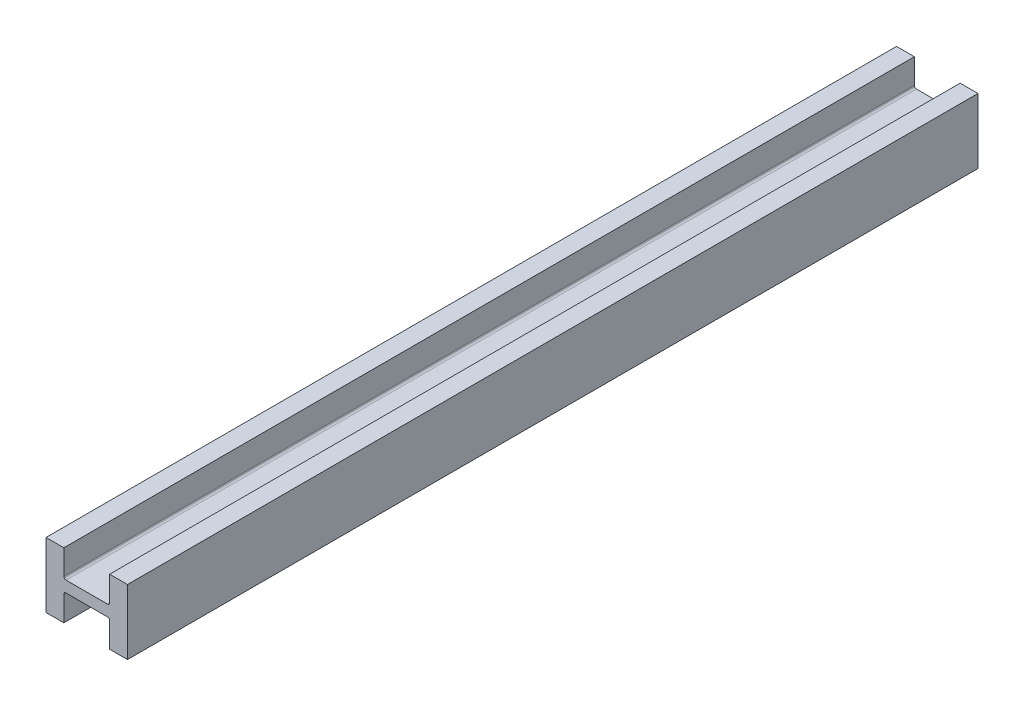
ISO-10303-21;
HEADER;
FILE_DESCRIPTION(('STEP AP214'),'2;1');
FILE_NAME('part.step','',(''),(''),'','','');
FILE_SCHEMA(('AUTOMOTIVE_DESIGN { 1 0 10303 214 1 1 1 1 }'));
ENDSEC;
DATA;
#1=APPLICATION_CONTEXT('core data for automotive mechanical design processes');
#2=APPLICATION_PROTOCOL_DEFINITION('international standard','automotive_design',2000,#1);
#3=PRODUCT_CONTEXT('',#1,'mechanical');
#4=PRODUCT('Part','Part','',(#3));
#5=PRODUCT_RELATED_PRODUCT_CATEGORY('part','',(#4));
#6=PRODUCT_DEFINITION_FORMATION('','',#4);
#7=PRODUCT_DEFINITION_CONTEXT('part definition',#1,'design');
#8=PRODUCT_DEFINITION('design','',#6,#7);
#9=PRODUCT_DEFINITION_SHAPE('','',#8);
#10=(LENGTH_UNIT() NAMED_UNIT(*) SI_UNIT(.MILLI.,.METRE.));
#11=(NAMED_UNIT(*) PLANE_ANGLE_UNIT() SI_UNIT($,.RADIAN.));
#12=(NAMED_UNIT(*) SI_UNIT($,.STERADIAN.) SOLID_ANGLE_UNIT());
#13=UNCERTAINTY_MEASURE_WITH_UNIT(LENGTH_MEASURE(1.E-05),#10,'distance_accuracy_value','');
#14=(GEOMETRIC_REPRESENTATION_CONTEXT(3) GLOBAL_UNCERTAINTY_ASSIGNED_CONTEXT((#13)) GLOBAL_UNIT_ASSIGNED_CONTEXT((#10,
#11,#12)) REPRESENTATION_CONTEXT('',''));
#15=CARTESIAN_POINT('',(0.,0.,0.));
#16=DIRECTION('',(0.,0.,1.));
#17=DIRECTION('',(1.,0.,0.));
#18=AXIS2_PLACEMENT_3D('',#15,#16,#17);
#19=CARTESIAN_POINT('',(284.734,227.203,2971.8));
#20=DIRECTION('',(-1.,0.,0.));
#21=DIRECTION('',(0.,0.,1.));
#22=AXIS2_PLACEMENT_3D('',#19,#20,#21);
#23=PLANE('',#22);
#24=DIRECTION('',(0.,1.,0.));
#25=VECTOR('',#24,1.);
#26=CARTESIAN_POINT('',(284.734,227.203,-2971.8));
#27=LINE('',#26,#25);
#28=CARTESIAN_POINT('',(284.734,-227.203,-2971.8));
#29=VERTEX_POINT('',#28);
#30=CARTESIAN_POINT('',(284.734,227.203,-2971.8));
#31=VERTEX_POINT('',#30);
#32=EDGE_CURVE('E194',#29,#31,#27,.T.);
#33=ORIENTED_EDGE('',*,*,#32,.T.);
#34=DIRECTION('',(0.,0.,-1.));
#35=VECTOR('',#34,1.);
#36=CARTESIAN_POINT('',(284.734,227.203,2971.8));
#37=LINE('',#36,#35);
#38=CARTESIAN_POINT('',(284.734,227.203,2971.8));
#39=VERTEX_POINT('',#38);
#40=EDGE_CURVE('E11',#39,#31,#37,.T.);
#41=ORIENTED_EDGE('',*,*,#40,.F.);
#42=DIRECTION('',(0.,1.,0.));
#43=VECTOR('',#42,1.);
#44=CARTESIAN_POINT('',(284.734,227.203,2971.8));
#45=LINE('',#44,#43);
#46=CARTESIAN_POINT('',(284.734,-227.203,2971.8));
#47=VERTEX_POINT('',#46);
#48=EDGE_CURVE('E238',#47,#39,#45,.T.);
#49=ORIENTED_EDGE('',*,*,#48,.F.);
#50=DIRECTION('',(0.,0.,-1.));
#51=VECTOR('',#50,1.);
#52=CARTESIAN_POINT('',(284.734,-227.203,2971.8));
#53=LINE('',#52,#51);
#54=EDGE_CURVE('E188',#47,#29,#53,.T.);
#55=ORIENTED_EDGE('',*,*,#54,.T.);
#56=EDGE_LOOP('',(#33,#41,#49,#55));
#57=FACE_BOUND('',#56,.T.);
#58=ADVANCED_FACE('F44',(#57),#23,.F.);
#59=CARTESIAN_POINT('',(160.02,227.203,2971.8));
#60=DIRECTION('',(0.,-1.,0.));
#61=DIRECTION('',(0.,0.,-1.));
#62=AXIS2_PLACEMENT_3D('',#59,#60,#61);
#63=PLANE('',#62);
#64=DIRECTION('',(-1.,0.,0.));
#65=VECTOR('',#64,1.);
#66=CARTESIAN_POINT('',(160.02,227.203,-2971.8));
#67=LINE('',#66,#65);
#68=CARTESIAN_POINT('',(160.02,227.203,-2971.8));
#69=VERTEX_POINT('',#68);
#70=EDGE_CURVE('E196',#31,#69,#67,.T.);
#71=ORIENTED_EDGE('',*,*,#70,.T.);
#72=DIRECTION('',(0.,0.,-1.));
#73=VECTOR('',#72,1.);
#74=CARTESIAN_POINT('',(160.02,227.203,2971.8));
#75=LINE('',#74,#73);
#76=CARTESIAN_POINT('',(160.02,227.203,2971.8));
#77=VERTEX_POINT('',#76);
#78=EDGE_CURVE('E53',#77,#69,#75,.T.);
#79=ORIENTED_EDGE('',*,*,#78,.F.);
#80=DIRECTION('',(-1.,0.,0.));
#81=VECTOR('',#80,1.);
#82=CARTESIAN_POINT('',(160.02,227.203,2971.8));
#83=LINE('',#82,#81);
#84=EDGE_CURVE('E129',#39,#77,#83,.T.);
#85=ORIENTED_EDGE('',*,*,#84,.F.);
#86=ORIENTED_EDGE('',*,*,#40,.T.);
#87=EDGE_LOOP('',(#71,#79,#85,#86));
#88=FACE_BOUND('',#87,.T.);
#89=ADVANCED_FACE('F362',(#88),#63,.F.);
#90=CARTESIAN_POINT('',(160.02,54.229,2971.8));
#91=DIRECTION('',(1.,0.,0.));
#92=DIRECTION('',(0.,0.,-1.));
#93=AXIS2_PLACEMENT_3D('',#90,#91,#92);
#94=PLANE('',#93);
#95=DIRECTION('',(0.,-1.,0.));
#96=VECTOR('',#95,1.);
#97=CARTESIAN_POINT('',(160.02,54.229,-2971.8));
#98=LINE('',#97,#96);
#99=CARTESIAN_POINT('',(160.02,54.229,-2971.8));
#100=VERTEX_POINT('',#99);
#101=EDGE_CURVE('E203',#69,#100,#98,.T.);
#102=ORIENTED_EDGE('',*,*,#101,.T.);
#103=DIRECTION('',(0.,0.,-1.));
#104=VECTOR('',#103,1.);
#105=CARTESIAN_POINT('',(160.02,54.229,2971.8));
#106=LINE('',#105,#104);
#107=CARTESIAN_POINT('',(160.02,54.229,2971.8));
#108=VERTEX_POINT('',#107);
#109=EDGE_CURVE('E284',#108,#100,#106,.T.);
#110=ORIENTED_EDGE('',*,*,#109,.F.);
#111=DIRECTION('',(0.,-1.,0.));
#112=VECTOR('',#111,1.);
#113=CARTESIAN_POINT('',(160.02,54.229,2971.8));
#114=LINE('',#113,#112);
#115=EDGE_CURVE('E291',#77,#108,#114,.T.);
#116=ORIENTED_EDGE('',*,*,#115,.F.);
#117=ORIENTED_EDGE('',*,*,#78,.T.);
#118=EDGE_LOOP('',(#102,#110,#116,#117));
#119=FACE_BOUND('',#118,.T.);
#120=ADVANCED_FACE('F292',(#119),#94,.F.);
#121=CARTESIAN_POINT('',(144.78,54.229,2971.8));
#122=DIRECTION('',(0.,0.,-1.));
#123=DIRECTION('',(-1.,0.,0.));
#124=AXIS2_PLACEMENT_3D('',#121,#122,#123);
#125=CYLINDRICAL_SURFACE('',#124,15.24);
#126=CARTESIAN_POINT('',(144.78,54.229,-2971.8));
#127=DIRECTION('',(0.,0.,-1.));
#128=DIRECTION('',(1.,0.,0.));
#129=AXIS2_PLACEMENT_3D('',#126,#127,#128);
#130=CIRCLE('',#129,15.24);
#131=CARTESIAN_POINT('',(144.78,38.989,-2971.8));
#132=VERTEX_POINT('',#131);
#133=EDGE_CURVE('E204',#100,#132,#130,.T.);
#134=ORIENTED_EDGE('',*,*,#133,.T.);
#135=DIRECTION('',(0.,0.,-1.));
#136=VECTOR('',#135,1.);
#137=CARTESIAN_POINT('',(144.78,38.989,2971.8));
#138=LINE('',#137,#136);
#139=CARTESIAN_POINT('',(144.78,38.989,2971.8));
#140=VERTEX_POINT('',#139);
#141=EDGE_CURVE('E276',#140,#132,#138,.T.);
#142=ORIENTED_EDGE('',*,*,#141,.F.);
#143=CARTESIAN_POINT('',(144.78,54.229,2971.8));
#144=DIRECTION('',(0.,0.,-1.));
#145=DIRECTION('',(1.,0.,0.));
#146=AXIS2_PLACEMENT_3D('',#143,#144,#145);
#147=CIRCLE('',#146,15.24);
#148=EDGE_CURVE('E315',#108,#140,#147,.T.);
#149=ORIENTED_EDGE('',*,*,#148,.F.);
#150=ORIENTED_EDGE('',*,*,#109,.T.);
#151=EDGE_LOOP('',(#134,#142,#149,#150));
#152=FACE_BOUND('',#151,.T.);
#153=ADVANCED_FACE('F305',(#152),#125,.F.);
#154=CARTESIAN_POINT('',(-144.78,38.989,2971.8));
#155=DIRECTION('',(0.,-1.,0.));
#156=DIRECTION('',(0.,0.,-1.));
#157=AXIS2_PLACEMENT_3D('',#154,#155,#156);
#158=PLANE('',#157);
#159=DIRECTION('',(-1.,0.,0.));
#160=VECTOR('',#159,1.);
#161=CARTESIAN_POINT('',(-144.78,38.989,-2971.8));
#162=LINE('',#161,#160);
#163=CARTESIAN_POINT('',(-144.78,38.989,-2971.8));
#164=VERTEX_POINT('',#163);
#165=EDGE_CURVE('E210',#132,#164,#162,.T.);
#166=ORIENTED_EDGE('',*,*,#165,.T.);
#167=DIRECTION('',(0.,0.,-1.));
#168=VECTOR('',#167,1.);
#169=CARTESIAN_POINT('',(-144.78,38.989,2971.8));
#170=LINE('',#169,#168);
#171=CARTESIAN_POINT('',(-144.78,38.989,2971.8));
#172=VERTEX_POINT('',#171);
#173=EDGE_CURVE('E274',#172,#164,#170,.T.);
#174=ORIENTED_EDGE('',*,*,#173,.F.);
#175=DIRECTION('',(-1.,0.,0.));
#176=VECTOR('',#175,1.);
#177=CARTESIAN_POINT('',(-144.78,38.989,2971.8));
#178=LINE('',#177,#176);
#179=EDGE_CURVE('E306',#140,#172,#178,.T.);
#180=ORIENTED_EDGE('',*,*,#179,.F.);
#181=ORIENTED_EDGE('',*,*,#141,.T.);
#182=EDGE_LOOP('',(#166,#174,#180,#181));
#183=FACE_BOUND('',#182,.T.);
#184=ADVANCED_FACE('F308',(#183),#158,.F.);
#185=CARTESIAN_POINT('',(-144.78,54.229,2971.8));
#186=DIRECTION('',(0.,0.,-1.));
#187=DIRECTION('',(-1.,0.,0.));
#188=AXIS2_PLACEMENT_3D('',#185,#186,#187);
#189=CYLINDRICAL_SURFACE('',#188,15.24);
#190=CARTESIAN_POINT('',(-144.78,54.229,-2971.8));
#191=DIRECTION('',(0.,0.,-1.));
#192=DIRECTION('',(1.,0.,0.));
#193=AXIS2_PLACEMENT_3D('',#190,#191,#192);
#194=CIRCLE('',#193,15.24);
#195=CARTESIAN_POINT('',(-160.02,54.229,-2971.8));
#196=VERTEX_POINT('',#195);
#197=EDGE_CURVE('E209',#164,#196,#194,.T.);
#198=ORIENTED_EDGE('',*,*,#197,.T.);
#199=DIRECTION('',(0.,0.,-1.));
#200=VECTOR('',#199,1.);
#201=CARTESIAN_POINT('',(-160.02,54.229,2971.8));
#202=LINE('',#201,#200);
#203=CARTESIAN_POINT('',(-160.02,54.229,2971.8));
#204=VERTEX_POINT('',#203);
#205=EDGE_CURVE('E271',#204,#196,#202,.T.);
#206=ORIENTED_EDGE('',*,*,#205,.F.);
#207=CARTESIAN_POINT('',(-144.78,54.229,2971.8));
#208=DIRECTION('',(0.,0.,-1.));
#209=DIRECTION('',(1.,0.,0.));
#210=AXIS2_PLACEMENT_3D('',#207,#208,#209);
#211=CIRCLE('',#210,15.24);
#212=EDGE_CURVE('E313',#172,#204,#211,.T.);
#213=ORIENTED_EDGE('',*,*,#212,.F.);
#214=ORIENTED_EDGE('',*,*,#173,.T.);
#215=EDGE_LOOP('',(#198,#206,#213,#214));
#216=FACE_BOUND('',#215,.T.);
#217=ADVANCED_FACE('F374',(#216),#189,.F.);
#218=CARTESIAN_POINT('',(-160.02,227.203,2971.8));
#219=DIRECTION('',(-1.,0.,0.));
#220=DIRECTION('',(0.,0.,1.));
#221=AXIS2_PLACEMENT_3D('',#218,#219,#220);
#222=PLANE('',#221);
#223=DIRECTION('',(0.,1.,0.));
#224=VECTOR('',#223,1.);
#225=CARTESIAN_POINT('',(-160.02,227.203,-2971.8));
#226=LINE('',#225,#224);
#227=CARTESIAN_POINT('',(-160.02,227.203,-2971.8));
#228=VERTEX_POINT('',#227);
#229=EDGE_CURVE('E213',#196,#228,#226,.T.);
#230=ORIENTED_EDGE('',*,*,#229,.T.);
#231=DIRECTION('',(0.,0.,-1.));
#232=VECTOR('',#231,1.);
#233=CARTESIAN_POINT('',(-160.02,227.203,2971.8));
#234=LINE('',#233,#232);
#235=CARTESIAN_POINT('',(-160.02,227.203,2971.8));
#236=VERTEX_POINT('',#235);
#237=EDGE_CURVE('E270',#236,#228,#234,.T.);
#238=ORIENTED_EDGE('',*,*,#237,.F.);
#239=DIRECTION('',(0.,1.,0.));
#240=VECTOR('',#239,1.);
#241=CARTESIAN_POINT('',(-160.02,227.203,2971.8));
#242=LINE('',#241,#240);
#243=EDGE_CURVE('E316',#204,#236,#242,.T.);
#244=ORIENTED_EDGE('',*,*,#243,.F.);
#245=ORIENTED_EDGE('',*,*,#205,.T.);
#246=EDGE_LOOP('',(#230,#238,#244,#245));
#247=FACE_BOUND('',#246,.T.);
#248=ADVANCED_FACE('F378',(#247),#222,.F.);
#249=CARTESIAN_POINT('',(-284.734,227.203,2971.8));
#250=DIRECTION('',(0.,-1.,0.));
#251=DIRECTION('',(0.,0.,-1.));
#252=AXIS2_PLACEMENT_3D('',#249,#250,#251);
#253=PLANE('',#252);
#254=DIRECTION('',(-1.,0.,0.));
#255=VECTOR('',#254,1.);
#256=CARTESIAN_POINT('',(-284.734,227.203,-2971.8));
#257=LINE('',#256,#255);
#258=CARTESIAN_POINT('',(-284.734,227.203,-2971.8));
#259=VERTEX_POINT('',#258);
#260=EDGE_CURVE('E216',#228,#259,#257,.T.);
#261=ORIENTED_EDGE('',*,*,#260,.T.);
#262=DIRECTION('',(0.,0.,-1.));
#263=VECTOR('',#262,1.);
#264=CARTESIAN_POINT('',(-284.734,227.203,2971.8));
#265=LINE('',#264,#263);
#266=CARTESIAN_POINT('',(-284.734,227.203,2971.8));
#267=VERTEX_POINT('',#266);
#268=EDGE_CURVE('E263',#267,#259,#265,.T.);
#269=ORIENTED_EDGE('',*,*,#268,.F.);
#270=DIRECTION('',(-1.,0.,0.));
#271=VECTOR('',#270,1.);
#272=CARTESIAN_POINT('',(-284.734,227.203,2971.8));
#273=LINE('',#272,#271);
#274=EDGE_CURVE('E323',#236,#267,#273,.T.);
#275=ORIENTED_EDGE('',*,*,#274,.F.);
#276=ORIENTED_EDGE('',*,*,#237,.T.);
#277=EDGE_LOOP('',(#261,#269,#275,#276));
#278=FACE_BOUND('',#277,.T.);
#279=ADVANCED_FACE('F385',(#278),#253,.F.);
#280=CARTESIAN_POINT('',(-284.734,-227.203,2971.8));
#281=DIRECTION('',(1.,0.,0.));
#282=DIRECTION('',(0.,0.,-1.));
#283=AXIS2_PLACEMENT_3D('',#280,#281,#282);
#284=PLANE('',#283);
#285=DIRECTION('',(0.,-1.,0.));
#286=VECTOR('',#285,1.);
#287=CARTESIAN_POINT('',(-284.734,-227.203,-2971.8));
#288=LINE('',#287,#286);
#289=CARTESIAN_POINT('',(-284.734,-227.203,-2971.8));
#290=VERTEX_POINT('',#289);
#291=EDGE_CURVE('E218',#259,#290,#288,.T.);
#292=ORIENTED_EDGE('',*,*,#291,.T.);
#293=DIRECTION('',(0.,0.,-1.));
#294=VECTOR('',#293,1.);
#295=CARTESIAN_POINT('',(-284.734,-227.203,2971.8));
#296=LINE('',#295,#294);
#297=CARTESIAN_POINT('',(-284.734,-227.203,2971.8));
#298=VERTEX_POINT('',#297);
#299=EDGE_CURVE('E259',#298,#290,#296,.T.);
#300=ORIENTED_EDGE('',*,*,#299,.F.);
#301=DIRECTION('',(0.,-1.,0.));
#302=VECTOR('',#301,1.);
#303=CARTESIAN_POINT('',(-284.734,-227.203,2971.8));
#304=LINE('',#303,#302);
#305=EDGE_CURVE('E326',#267,#298,#304,.T.);
#306=ORIENTED_EDGE('',*,*,#305,.F.);
#307=ORIENTED_EDGE('',*,*,#268,.T.);
#308=EDGE_LOOP('',(#292,#300,#306,#307));
#309=FACE_BOUND('',#308,.T.);
#310=ADVANCED_FACE('F387',(#309),#284,.F.);
#311=CARTESIAN_POINT('',(-160.02,-227.203,2971.8));
#312=DIRECTION('',(0.,1.,0.));
#313=DIRECTION('',(0.,0.,1.));
#314=AXIS2_PLACEMENT_3D('',#311,#312,#313);
#315=PLANE('',#314);
#316=DIRECTION('',(1.,0.,0.));
#317=VECTOR('',#316,1.);
#318=CARTESIAN_POINT('',(-160.02,-227.203,-2971.8));
#319=LINE('',#318,#317);
#320=CARTESIAN_POINT('',(-160.02,-227.203,-2971.8));
#321=VERTEX_POINT('',#320);
#322=EDGE_CURVE('E225',#290,#321,#319,.T.);
#323=ORIENTED_EDGE('',*,*,#322,.T.);
#324=DIRECTION('',(0.,0.,-1.));
#325=VECTOR('',#324,1.);
#326=CARTESIAN_POINT('',(-160.02,-227.203,2971.8));
#327=LINE('',#326,#325);
#328=CARTESIAN_POINT('',(-160.02,-227.203,2971.8));
#329=VERTEX_POINT('',#328);
#330=EDGE_CURVE('E254',#329,#321,#327,.T.);
#331=ORIENTED_EDGE('',*,*,#330,.F.);
#332=DIRECTION('',(1.,0.,0.));
#333=VECTOR('',#332,1.);
#334=CARTESIAN_POINT('',(-160.02,-227.203,2971.8));
#335=LINE('',#334,#333);
#336=EDGE_CURVE('E328',#298,#329,#335,.T.);
#337=ORIENTED_EDGE('',*,*,#336,.F.);
#338=ORIENTED_EDGE('',*,*,#299,.T.);
#339=EDGE_LOOP('',(#323,#331,#337,#338));
#340=FACE_BOUND('',#339,.T.);
#341=ADVANCED_FACE('F388',(#340),#315,.F.);
#342=CARTESIAN_POINT('',(-160.02,-54.229,2971.8));
#343=DIRECTION('',(-1.,0.,0.));
#344=DIRECTION('',(0.,0.,1.));
#345=AXIS2_PLACEMENT_3D('',#342,#343,#344);
#346=PLANE('',#345);
#347=DIRECTION('',(0.,1.,0.));
#348=VECTOR('',#347,1.);
#349=CARTESIAN_POINT('',(-160.02,-54.229,-2971.8));
#350=LINE('',#349,#348);
#351=CARTESIAN_POINT('',(-160.02,-54.229,-2971.8));
#352=VERTEX_POINT('',#351);
#353=EDGE_CURVE('E223',#321,#352,#350,.T.);
#354=ORIENTED_EDGE('',*,*,#353,.T.);
#355=DIRECTION('',(0.,0.,-1.));
#356=VECTOR('',#355,1.);
#357=CARTESIAN_POINT('',(-160.02,-54.229,2971.8));
#358=LINE('',#357,#356);
#359=CARTESIAN_POINT('',(-160.02,-54.229,2971.8));
#360=VERTEX_POINT('',#359);
#361=EDGE_CURVE('E253',#360,#352,#358,.T.);
#362=ORIENTED_EDGE('',*,*,#361,.F.);
#363=DIRECTION('',(0.,1.,0.));
#364=VECTOR('',#363,1.);
#365=CARTESIAN_POINT('',(-160.02,-54.229,2971.8));
#366=LINE('',#365,#364);
#367=EDGE_CURVE('E335',#329,#360,#366,.T.);
#368=ORIENTED_EDGE('',*,*,#367,.F.);
#369=ORIENTED_EDGE('',*,*,#330,.T.);
#370=EDGE_LOOP('',(#354,#362,#368,#369));
#371=FACE_BOUND('',#370,.T.);
#372=ADVANCED_FACE('F391',(#371),#346,.F.);
#373=CARTESIAN_POINT('',(-144.78,-54.229,2971.8));
#374=DIRECTION('',(0.,0.,-1.));
#375=DIRECTION('',(-1.,0.,0.));
#376=AXIS2_PLACEMENT_3D('',#373,#374,#375);
#377=CYLINDRICAL_SURFACE('',#376,15.24);
#378=CARTESIAN_POINT('',(-144.78,-54.229,-2971.8));
#379=DIRECTION('',(0.,0.,-1.));
#380=DIRECTION('',(1.,0.,0.));
#381=AXIS2_PLACEMENT_3D('',#378,#379,#380);
#382=CIRCLE('',#381,15.24);
#383=CARTESIAN_POINT('',(-144.78,-38.989,-2971.8));
#384=VERTEX_POINT('',#383);
#385=EDGE_CURVE('E229',#352,#384,#382,.T.);
#386=ORIENTED_EDGE('',*,*,#385,.T.);
#387=DIRECTION('',(0.,0.,-1.));
#388=VECTOR('',#387,1.);
#389=CARTESIAN_POINT('',(-144.78,-38.989,2971.8));
#390=LINE('',#389,#388);
#391=CARTESIAN_POINT('',(-144.78,-38.989,2971.8));
#392=VERTEX_POINT('',#391);
#393=EDGE_CURVE('E250',#392,#384,#390,.T.);
#394=ORIENTED_EDGE('',*,*,#393,.F.);
#395=CARTESIAN_POINT('',(-144.78,-54.229,2971.8));
#396=DIRECTION('',(0.,0.,-1.));
#397=DIRECTION('',(1.,0.,0.));
#398=AXIS2_PLACEMENT_3D('',#395,#396,#397);
#399=CIRCLE('',#398,15.24);
#400=EDGE_CURVE('E333',#360,#392,#399,.T.);
#401=ORIENTED_EDGE('',*,*,#400,.F.);
#402=ORIENTED_EDGE('',*,*,#361,.T.);
#403=EDGE_LOOP('',(#386,#394,#401,#402));
#404=FACE_BOUND('',#403,.T.);
#405=ADVANCED_FACE('F343',(#404),#377,.F.);
#406=CARTESIAN_POINT('',(144.78,-38.989,2971.8));
#407=DIRECTION('',(0.,1.,0.));
#408=DIRECTION('',(-1.,0.,0.));
#409=AXIS2_PLACEMENT_3D('',#406,#407,#408);
#410=PLANE('',#409);
#411=DIRECTION('',(1.,0.,0.));
#412=VECTOR('',#411,1.);
#413=CARTESIAN_POINT('',(144.78,-38.989,-2971.8));
#414=LINE('',#413,#412);
#415=CARTESIAN_POINT('',(144.78,-38.989,-2971.8));
#416=VERTEX_POINT('',#415);
#417=EDGE_CURVE('E232',#384,#416,#414,.T.);
#418=ORIENTED_EDGE('',*,*,#417,.T.);
#419=DIRECTION('',(0.,0.,-1.));
#420=VECTOR('',#419,1.);
#421=CARTESIAN_POINT('',(144.78,-38.989,2971.8));
#422=LINE('',#421,#420);
#423=CARTESIAN_POINT('',(144.78,-38.989,2971.8));
#424=VERTEX_POINT('',#423);
#425=EDGE_CURVE('E181',#424,#416,#422,.T.);
#426=ORIENTED_EDGE('',*,*,#425,.F.);
#427=DIRECTION('',(1.,0.,0.));
#428=VECTOR('',#427,1.);
#429=CARTESIAN_POINT('',(144.78,-38.989,2971.8));
#430=LINE('',#429,#428);
#431=EDGE_CURVE('E175',#392,#424,#430,.T.);
#432=ORIENTED_EDGE('',*,*,#431,.F.);
#433=ORIENTED_EDGE('',*,*,#393,.T.);
#434=EDGE_LOOP('',(#418,#426,#432,#433));
#435=FACE_BOUND('',#434,.T.);
#436=ADVANCED_FACE('F350',(#435),#410,.F.);
#437=CARTESIAN_POINT('',(144.78,-54.229,2971.8));
#438=DIRECTION('',(0.,0.,-1.));
#439=DIRECTION('',(-1.,0.,0.));
#440=AXIS2_PLACEMENT_3D('',#437,#438,#439);
#441=CYLINDRICAL_SURFACE('',#440,15.24);
#442=CARTESIAN_POINT('',(144.78,-54.229,-2971.8));
#443=DIRECTION('',(0.,0.,-1.));
#444=DIRECTION('',(1.,0.,0.));
#445=AXIS2_PLACEMENT_3D('',#442,#443,#444);
#446=CIRCLE('',#445,15.24);
#447=CARTESIAN_POINT('',(160.02,-54.229,-2971.8));
#448=VERTEX_POINT('',#447);
#449=EDGE_CURVE('E182',#416,#448,#446,.T.);
#450=ORIENTED_EDGE('',*,*,#449,.T.);
#451=DIRECTION('',(0.,0.,-1.));
#452=VECTOR('',#451,1.);
#453=CARTESIAN_POINT('',(160.02,-54.229,2971.8));
#454=LINE('',#453,#452);
#455=CARTESIAN_POINT('',(160.02,-54.229,2971.8));
#456=VERTEX_POINT('',#455);
#457=EDGE_CURVE('E178',#456,#448,#454,.T.);
#458=ORIENTED_EDGE('',*,*,#457,.F.);
#459=CARTESIAN_POINT('',(144.78,-54.229,2971.8));
#460=DIRECTION('',(0.,0.,-1.));
#461=DIRECTION('',(1.,0.,0.));
#462=AXIS2_PLACEMENT_3D('',#459,#460,#461);
#463=CIRCLE('',#462,15.24);
#464=EDGE_CURVE('E167',#424,#456,#463,.T.);
#465=ORIENTED_EDGE('',*,*,#464,.F.);
#466=ORIENTED_EDGE('',*,*,#425,.T.);
#467=EDGE_LOOP('',(#450,#458,#465,#466));
#468=FACE_BOUND('',#467,.T.);
#469=ADVANCED_FACE('F179',(#468),#441,.F.);
#470=CARTESIAN_POINT('',(160.02,-227.203,2971.8));
#471=DIRECTION('',(1.,0.,0.));
#472=DIRECTION('',(0.,0.,-1.));
#473=AXIS2_PLACEMENT_3D('',#470,#471,#472);
#474=PLANE('',#473);
#475=DIRECTION('',(0.,-1.,0.));
#476=VECTOR('',#475,1.);
#477=CARTESIAN_POINT('',(160.02,-227.203,-2971.8));
#478=LINE('',#477,#476);
#479=CARTESIAN_POINT('',(160.02,-227.203,-2971.8));
#480=VERTEX_POINT('',#479);
#481=EDGE_CURVE('E113',#448,#480,#478,.T.);
#482=ORIENTED_EDGE('',*,*,#481,.T.);
#483=DIRECTION('',(0.,0.,-1.));
#484=VECTOR('',#483,1.);
#485=CARTESIAN_POINT('',(160.02,-227.203,2971.8));
#486=LINE('',#485,#484);
#487=CARTESIAN_POINT('',(160.02,-227.203,2971.8));
#488=VERTEX_POINT('',#487);
#489=EDGE_CURVE('E184',#488,#480,#486,.T.);
#490=ORIENTED_EDGE('',*,*,#489,.F.);
#491=DIRECTION('',(0.,-1.,0.));
#492=VECTOR('',#491,1.);
#493=CARTESIAN_POINT('',(160.02,-227.203,2971.8));
#494=LINE('',#493,#492);
#495=EDGE_CURVE('E168',#456,#488,#494,.T.);
#496=ORIENTED_EDGE('',*,*,#495,.F.);
#497=ORIENTED_EDGE('',*,*,#457,.T.);
#498=EDGE_LOOP('',(#482,#490,#496,#497));
#499=FACE_BOUND('',#498,.T.);
#500=ADVANCED_FACE('F187',(#499),#474,.F.);
#501=CARTESIAN_POINT('',(284.734,-227.203,2971.8));
#502=DIRECTION('',(0.,1.,0.));
#503=DIRECTION('',(0.,0.,1.));
#504=AXIS2_PLACEMENT_3D('',#501,#502,#503);
#505=PLANE('',#504);
#506=DIRECTION('',(1.,0.,0.));
#507=VECTOR('',#506,1.);
#508=CARTESIAN_POINT('',(284.734,-227.203,-2971.8));
#509=LINE('',#508,#507);
#510=EDGE_CURVE('E122',#480,#29,#509,.T.);
#511=ORIENTED_EDGE('',*,*,#510,.T.);
#512=ORIENTED_EDGE('',*,*,#54,.F.);
#513=DIRECTION('',(1.,0.,0.));
#514=VECTOR('',#513,1.);
#515=CARTESIAN_POINT('',(284.734,-227.203,2971.8));
#516=LINE('',#515,#514);
#517=EDGE_CURVE('E65',#488,#47,#516,.T.);
#518=ORIENTED_EDGE('',*,*,#517,.F.);
#519=ORIENTED_EDGE('',*,*,#489,.T.);
#520=EDGE_LOOP('',(#511,#512,#518,#519));
#521=FACE_BOUND('',#520,.T.);
#522=ADVANCED_FACE('F352',(#521),#505,.F.);
#523=CARTESIAN_POINT('',(144.78,-54.229,2971.8));
#524=DIRECTION('',(0.,0.,1.));
#525=DIRECTION('',(1.,0.,0.));
#526=AXIS2_PLACEMENT_3D('',#523,#524,#525);
#527=PLANE('',#526);
#528=ORIENTED_EDGE('',*,*,#48,.T.);
#529=ORIENTED_EDGE('',*,*,#84,.T.);
#530=ORIENTED_EDGE('',*,*,#115,.T.);
#531=ORIENTED_EDGE('',*,*,#148,.T.);
#532=ORIENTED_EDGE('',*,*,#179,.T.);
#533=ORIENTED_EDGE('',*,*,#212,.T.);
#534=ORIENTED_EDGE('',*,*,#243,.T.);
#535=ORIENTED_EDGE('',*,*,#274,.T.);
#536=ORIENTED_EDGE('',*,*,#305,.T.);
#537=ORIENTED_EDGE('',*,*,#336,.T.);
#538=ORIENTED_EDGE('',*,*,#367,.T.);
#539=ORIENTED_EDGE('',*,*,#400,.T.);
#540=ORIENTED_EDGE('',*,*,#431,.T.);
#541=ORIENTED_EDGE('',*,*,#464,.T.);
#542=ORIENTED_EDGE('',*,*,#495,.T.);
#543=ORIENTED_EDGE('',*,*,#517,.T.);
#544=EDGE_LOOP('',(#528,#529,#530,#531,#532,#533,#534,#535,#536,#537,#538,#539,#540,#541,#542,#543));
#545=FACE_BOUND('',#544,.T.);
#546=ADVANCED_FACE('F169',(#545),#527,.T.);
#547=CARTESIAN_POINT('',(144.78,-54.229,-2971.8));
#548=DIRECTION('',(0.,0.,1.));
#549=DIRECTION('',(1.,0.,0.));
#550=AXIS2_PLACEMENT_3D('',#547,#548,#549);
#551=PLANE('',#550);
#552=ORIENTED_EDGE('',*,*,#32,.F.);
#553=ORIENTED_EDGE('',*,*,#510,.F.);
#554=ORIENTED_EDGE('',*,*,#481,.F.);
#555=ORIENTED_EDGE('',*,*,#449,.F.);
#556=ORIENTED_EDGE('',*,*,#417,.F.);
#557=ORIENTED_EDGE('',*,*,#385,.F.);
#558=ORIENTED_EDGE('',*,*,#353,.F.);
#559=ORIENTED_EDGE('',*,*,#322,.F.);
#560=ORIENTED_EDGE('',*,*,#291,.F.);
#561=ORIENTED_EDGE('',*,*,#260,.F.);
#562=ORIENTED_EDGE('',*,*,#229,.F.);
#563=ORIENTED_EDGE('',*,*,#197,.F.);
#564=ORIENTED_EDGE('',*,*,#165,.F.);
#565=ORIENTED_EDGE('',*,*,#133,.F.);
#566=ORIENTED_EDGE('',*,*,#101,.F.);
#567=ORIENTED_EDGE('',*,*,#70,.F.);
#568=EDGE_LOOP('',(#552,#553,#554,#555,#556,#557,#558,#559,#560,#561,#562,#563,#564,#565,#566,#567));
#569=FACE_BOUND('',#568,.T.);
#570=ADVANCED_FACE('F300',(#569),#551,.F.);
#571=CLOSED_SHELL('',(#58,#89,#120,#153,#184,#217,#248,#279,#310,#341,#372,#405,#436,#469,#500,
#522,#546,#570));
#572=MANIFOLD_SOLID_BREP('B2',#571);
#573=ADVANCED_BREP_SHAPE_REPRESENTATION('',(#18,#572),#14);
#574=SHAPE_DEFINITION_REPRESENTATION(#9,#573);
ENDSEC;
END-ISO-10303-21;
